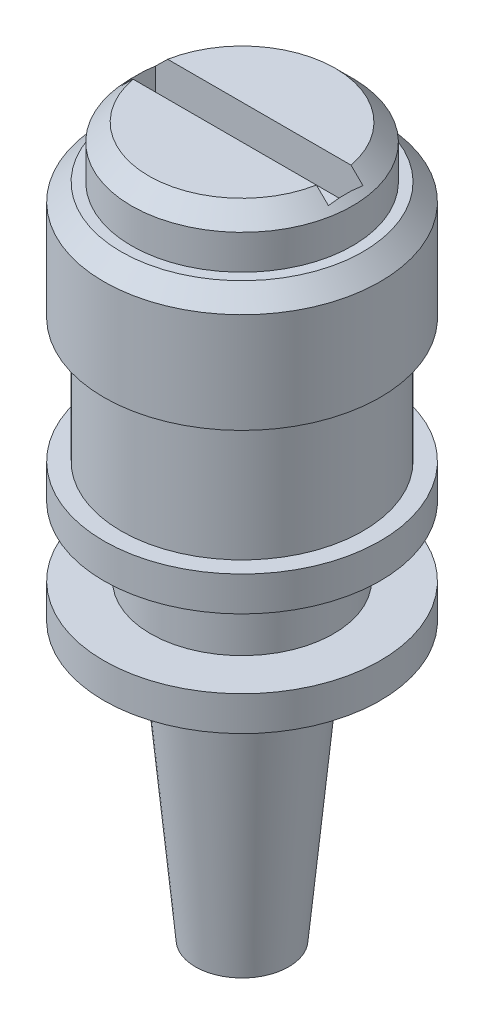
ISO-10303-21;
HEADER;
FILE_DESCRIPTION(('STEP AP214'),'2;1');
FILE_NAME('part.step','',(''),(''),'','','');
FILE_SCHEMA(('AUTOMOTIVE_DESIGN { 1 0 10303 214 1 1 1 1 }'));
ENDSEC;
DATA;
#1=APPLICATION_CONTEXT('core data for automotive mechanical design processes');
#2=APPLICATION_PROTOCOL_DEFINITION('international standard','automotive_design',2000,#1);
#3=PRODUCT_CONTEXT('',#1,'mechanical');
#4=PRODUCT('Part','Part','',(#3));
#5=PRODUCT_RELATED_PRODUCT_CATEGORY('part','',(#4));
#6=PRODUCT_DEFINITION_FORMATION('','',#4);
#7=PRODUCT_DEFINITION_CONTEXT('part definition',#1,'design');
#8=PRODUCT_DEFINITION('design','',#6,#7);
#9=PRODUCT_DEFINITION_SHAPE('','',#8);
#10=(LENGTH_UNIT() NAMED_UNIT(*) SI_UNIT(.MILLI.,.METRE.));
#11=(NAMED_UNIT(*) PLANE_ANGLE_UNIT() SI_UNIT($,.RADIAN.));
#12=(NAMED_UNIT(*) SI_UNIT($,.STERADIAN.) SOLID_ANGLE_UNIT());
#13=UNCERTAINTY_MEASURE_WITH_UNIT(LENGTH_MEASURE(1.E-05),#10,'distance_accuracy_value','');
#14=(GEOMETRIC_REPRESENTATION_CONTEXT(3) GLOBAL_UNCERTAINTY_ASSIGNED_CONTEXT((#13)) GLOBAL_UNIT_ASSIGNED_CONTEXT((#10,
#11,#12)) REPRESENTATION_CONTEXT('',''));
#15=CARTESIAN_POINT('',(0.,0.,0.));
#16=DIRECTION('',(0.,0.,1.));
#17=DIRECTION('',(1.,0.,0.));
#18=AXIS2_PLACEMENT_3D('',#15,#16,#17);
#19=CARTESIAN_POINT('',(-3.19999999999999,20.5,0.));
#20=DIRECTION('',(0.,1.,0.));
#21=DIRECTION('',(0.,0.,1.));
#22=AXIS2_PLACEMENT_3D('',#19,#20,#21);
#23=PLANE('',#22);
#24=DIRECTION('',(1.,0.,0.));
#25=VECTOR('',#24,1.);
#26=CARTESIAN_POINT('',(3.,20.5,0.5));
#27=LINE('',#26,#25);
#28=CARTESIAN_POINT('',(-2.65329983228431,20.5,0.5));
#29=VERTEX_POINT('',#28);
#30=CARTESIAN_POINT('',(2.65329983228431,20.5,0.5));
#31=VERTEX_POINT('',#30);
#32=EDGE_CURVE('E106',#29,#31,#27,.T.);
#33=ORIENTED_EDGE('',*,*,#32,.F.);
#34=CARTESIAN_POINT('',(0.,20.5,0.));
#35=DIRECTION('',(0.,1.,0.));
#36=DIRECTION('',(0.,0.,1.));
#37=AXIS2_PLACEMENT_3D('',#34,#35,#36);
#38=CIRCLE('',#37,2.69999999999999);
#39=EDGE_CURVE('E165',#29,#31,#38,.T.);
#40=ORIENTED_EDGE('',*,*,#39,.T.);
#41=EDGE_LOOP('',(#33,#40));
#42=FACE_BOUND('',#41,.T.);
#43=ADVANCED_FACE('F29',(#42),#23,.T.);
#44=CARTESIAN_POINT('',(0.,0.,0.));
#45=DIRECTION('',(0.,-1.,0.));
#46=DIRECTION('',(0.,0.,-1.));
#47=AXIS2_PLACEMENT_3D('',#44,#45,#46);
#48=PLANE('',#47);
#49=CARTESIAN_POINT('',(0.,0.,0.));
#50=DIRECTION('',(0.,1.,0.));
#51=DIRECTION('',(0.,0.,1.));
#52=AXIS2_PLACEMENT_3D('',#49,#50,#51);
#53=CIRCLE('',#52,1.34999999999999);
#54=CARTESIAN_POINT('',(0.,0.,1.34999999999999));
#55=VERTEX_POINT('',#54);
#56=EDGE_CURVE('E156',#55,#55,#53,.T.);
#57=ORIENTED_EDGE('',*,*,#56,.F.);
#58=EDGE_LOOP('',(#57));
#59=FACE_BOUND('',#58,.T.);
#60=ADVANCED_FACE('F31',(#59),#48,.T.);
#61=CARTESIAN_POINT('',(0.,6.99999999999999,0.));
#62=DIRECTION('',(0.,1.,0.));
#63=DIRECTION('',(0.,0.,1.));
#64=AXIS2_PLACEMENT_3D('',#61,#62,#63);
#65=CONICAL_SURFACE('',#64,1.99999999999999,0.0925916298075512);
#66=ORIENTED_EDGE('',*,*,#56,.T.);
#67=EDGE_LOOP('',(#66));
#68=FACE_BOUND('',#67,.T.);
#69=CARTESIAN_POINT('',(0.,6.99999999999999,0.));
#70=DIRECTION('',(0.,1.,0.));
#71=DIRECTION('',(0.,0.,1.));
#72=AXIS2_PLACEMENT_3D('',#69,#70,#71);
#73=CIRCLE('',#72,1.99999999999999);
#74=CARTESIAN_POINT('',(0.,6.99999999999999,1.99999999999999));
#75=VERTEX_POINT('',#74);
#76=EDGE_CURVE('E153',#75,#75,#73,.T.);
#77=ORIENTED_EDGE('',*,*,#76,.F.);
#78=EDGE_LOOP('',(#77));
#79=FACE_BOUND('',#78,.T.);
#80=ADVANCED_FACE('F220',(#68,#79),#65,.T.);
#81=CARTESIAN_POINT('',(0.,80.,0.));
#82=DIRECTION('',(0.,1.,0.));
#83=DIRECTION('',(0.,0.,1.));
#84=AXIS2_PLACEMENT_3D('',#81,#82,#83);
#85=CYLINDRICAL_SURFACE('',#84,1.99999999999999);
#86=ORIENTED_EDGE('',*,*,#76,.T.);
#87=EDGE_LOOP('',(#86));
#88=FACE_BOUND('',#87,.T.);
#89=CARTESIAN_POINT('',(0.,7.99999999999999,0.));
#90=DIRECTION('',(0.,1.,0.));
#91=DIRECTION('',(0.,0.,1.));
#92=AXIS2_PLACEMENT_3D('',#89,#90,#91);
#93=CIRCLE('',#92,1.99999999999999);
#94=CARTESIAN_POINT('',(0.,7.99999999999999,1.99999999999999));
#95=VERTEX_POINT('',#94);
#96=EDGE_CURVE('E150',#95,#95,#93,.T.);
#97=ORIENTED_EDGE('',*,*,#96,.F.);
#98=EDGE_LOOP('',(#97));
#99=FACE_BOUND('',#98,.T.);
#100=ADVANCED_FACE('F283',(#88,#99),#85,.T.);
#101=CARTESIAN_POINT('',(-1.99999999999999,8.,0.));
#102=DIRECTION('',(0.,-1.,0.));
#103=DIRECTION('',(0.,0.,-1.));
#104=AXIS2_PLACEMENT_3D('',#101,#102,#103);
#105=PLANE('',#104);
#106=ORIENTED_EDGE('',*,*,#96,.T.);
#107=EDGE_LOOP('',(#106));
#108=FACE_BOUND('',#107,.T.);
#109=CARTESIAN_POINT('',(0.,7.99999999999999,0.));
#110=DIRECTION('',(0.,1.,0.));
#111=DIRECTION('',(0.,0.,1.));
#112=AXIS2_PLACEMENT_3D('',#109,#110,#111);
#113=CIRCLE('',#112,3.99999999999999);
#114=CARTESIAN_POINT('',(0.,7.99999999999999,3.99999999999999));
#115=VERTEX_POINT('',#114);
#116=EDGE_CURVE('E147',#115,#115,#113,.T.);
#117=ORIENTED_EDGE('',*,*,#116,.F.);
#118=EDGE_LOOP('',(#117));
#119=FACE_BOUND('',#118,.T.);
#120=ADVANCED_FACE('F279',(#108,#119),#105,.T.);
#121=CARTESIAN_POINT('',(0.,80.,0.));
#122=DIRECTION('',(0.,1.,0.));
#123=DIRECTION('',(0.,0.,1.));
#124=AXIS2_PLACEMENT_3D('',#121,#122,#123);
#125=CYLINDRICAL_SURFACE('',#124,3.99999999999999);
#126=ORIENTED_EDGE('',*,*,#116,.T.);
#127=EDGE_LOOP('',(#126));
#128=FACE_BOUND('',#127,.T.);
#129=CARTESIAN_POINT('',(0.,8.99999999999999,0.));
#130=DIRECTION('',(0.,1.,0.));
#131=DIRECTION('',(0.,0.,1.));
#132=AXIS2_PLACEMENT_3D('',#129,#130,#131);
#133=CIRCLE('',#132,3.99999999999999);
#134=CARTESIAN_POINT('',(0.,8.99999999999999,3.99999999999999));
#135=VERTEX_POINT('',#134);
#136=EDGE_CURVE('E144',#135,#135,#133,.T.);
#137=ORIENTED_EDGE('',*,*,#136,.F.);
#138=EDGE_LOOP('',(#137));
#139=FACE_BOUND('',#138,.T.);
#140=ADVANCED_FACE('F275',(#128,#139),#125,.T.);
#141=CARTESIAN_POINT('',(-3.99999999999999,9.,0.));
#142=DIRECTION('',(0.,1.,0.));
#143=DIRECTION('',(0.,0.,1.));
#144=AXIS2_PLACEMENT_3D('',#141,#142,#143);
#145=PLANE('',#144);
#146=ORIENTED_EDGE('',*,*,#136,.T.);
#147=EDGE_LOOP('',(#146));
#148=FACE_BOUND('',#147,.T.);
#149=CARTESIAN_POINT('',(0.,8.99999999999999,0.));
#150=DIRECTION('',(0.,1.,0.));
#151=DIRECTION('',(0.,0.,1.));
#152=AXIS2_PLACEMENT_3D('',#149,#150,#151);
#153=CIRCLE('',#152,2.64999999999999);
#154=CARTESIAN_POINT('',(0.,8.99999999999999,2.64999999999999));
#155=VERTEX_POINT('',#154);
#156=EDGE_CURVE('E141',#155,#155,#153,.T.);
#157=ORIENTED_EDGE('',*,*,#156,.F.);
#158=EDGE_LOOP('',(#157));
#159=FACE_BOUND('',#158,.T.);
#160=ADVANCED_FACE('F271',(#148,#159),#145,.T.);
#161=CARTESIAN_POINT('',(0.,80.,0.));
#162=DIRECTION('',(0.,1.,0.));
#163=DIRECTION('',(0.,0.,1.));
#164=AXIS2_PLACEMENT_3D('',#161,#162,#163);
#165=CYLINDRICAL_SURFACE('',#164,2.64999999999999);
#166=ORIENTED_EDGE('',*,*,#156,.T.);
#167=EDGE_LOOP('',(#166));
#168=FACE_BOUND('',#167,.T.);
#169=CARTESIAN_POINT('',(0.,11.,0.));
#170=DIRECTION('',(0.,1.,0.));
#171=DIRECTION('',(0.,0.,1.));
#172=AXIS2_PLACEMENT_3D('',#169,#170,#171);
#173=CIRCLE('',#172,2.64999999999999);
#174=CARTESIAN_POINT('',(0.,11.,2.64999999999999));
#175=VERTEX_POINT('',#174);
#176=EDGE_CURVE('E138',#175,#175,#173,.T.);
#177=ORIENTED_EDGE('',*,*,#176,.F.);
#178=EDGE_LOOP('',(#177));
#179=FACE_BOUND('',#178,.T.);
#180=ADVANCED_FACE('F267',(#168,#179),#165,.T.);
#181=CARTESIAN_POINT('',(-2.64999999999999,11.,0.));
#182=DIRECTION('',(0.,-1.,0.));
#183=DIRECTION('',(0.,0.,-1.));
#184=AXIS2_PLACEMENT_3D('',#181,#182,#183);
#185=PLANE('',#184);
#186=ORIENTED_EDGE('',*,*,#176,.T.);
#187=EDGE_LOOP('',(#186));
#188=FACE_BOUND('',#187,.T.);
#189=CARTESIAN_POINT('',(0.,11.,0.));
#190=DIRECTION('',(0.,1.,0.));
#191=DIRECTION('',(0.,0.,1.));
#192=AXIS2_PLACEMENT_3D('',#189,#190,#191);
#193=CIRCLE('',#192,3.99999999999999);
#194=CARTESIAN_POINT('',(0.,11.,3.99999999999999));
#195=VERTEX_POINT('',#194);
#196=EDGE_CURVE('E135',#195,#195,#193,.T.);
#197=ORIENTED_EDGE('',*,*,#196,.F.);
#198=EDGE_LOOP('',(#197));
#199=FACE_BOUND('',#198,.T.);
#200=ADVANCED_FACE('F263',(#188,#199),#185,.T.);
#201=CARTESIAN_POINT('',(0.,80.,0.));
#202=DIRECTION('',(0.,1.,0.));
#203=DIRECTION('',(0.,0.,1.));
#204=AXIS2_PLACEMENT_3D('',#201,#202,#203);
#205=CYLINDRICAL_SURFACE('',#204,3.99999999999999);
#206=ORIENTED_EDGE('',*,*,#196,.T.);
#207=EDGE_LOOP('',(#206));
#208=FACE_BOUND('',#207,.T.);
#209=CARTESIAN_POINT('',(0.,12.,0.));
#210=DIRECTION('',(0.,1.,0.));
#211=DIRECTION('',(0.,0.,1.));
#212=AXIS2_PLACEMENT_3D('',#209,#210,#211);
#213=CIRCLE('',#212,3.99999999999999);
#214=CARTESIAN_POINT('',(0.,12.,3.99999999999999));
#215=VERTEX_POINT('',#214);
#216=EDGE_CURVE('E132',#215,#215,#213,.T.);
#217=ORIENTED_EDGE('',*,*,#216,.F.);
#218=EDGE_LOOP('',(#217));
#219=FACE_BOUND('',#218,.T.);
#220=ADVANCED_FACE('F259',(#208,#219),#205,.T.);
#221=CARTESIAN_POINT('',(-3.99999999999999,12.,0.));
#222=DIRECTION('',(0.,1.,0.));
#223=DIRECTION('',(0.,0.,1.));
#224=AXIS2_PLACEMENT_3D('',#221,#222,#223);
#225=PLANE('',#224);
#226=ORIENTED_EDGE('',*,*,#216,.T.);
#227=EDGE_LOOP('',(#226));
#228=FACE_BOUND('',#227,.T.);
#229=CARTESIAN_POINT('',(0.,12.,0.));
#230=DIRECTION('',(0.,1.,0.));
#231=DIRECTION('',(0.,0.,1.));
#232=AXIS2_PLACEMENT_3D('',#229,#230,#231);
#233=CIRCLE('',#232,3.5);
#234=CARTESIAN_POINT('',(0.,12.,3.5));
#235=VERTEX_POINT('',#234);
#236=EDGE_CURVE('E129',#235,#235,#233,.T.);
#237=ORIENTED_EDGE('',*,*,#236,.F.);
#238=EDGE_LOOP('',(#237));
#239=FACE_BOUND('',#238,.T.);
#240=ADVANCED_FACE('F255',(#228,#239),#225,.T.);
#241=CARTESIAN_POINT('',(0.,80.,0.));
#242=DIRECTION('',(0.,1.,0.));
#243=DIRECTION('',(0.,0.,1.));
#244=AXIS2_PLACEMENT_3D('',#241,#242,#243);
#245=CYLINDRICAL_SURFACE('',#244,3.49999999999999);
#246=ORIENTED_EDGE('',*,*,#236,.T.);
#247=EDGE_LOOP('',(#246));
#248=FACE_BOUND('',#247,.T.);
#249=CARTESIAN_POINT('',(0.,15.6,0.));
#250=DIRECTION('',(0.,1.,0.));
#251=DIRECTION('',(0.,0.,1.));
#252=AXIS2_PLACEMENT_3D('',#249,#250,#251);
#253=CIRCLE('',#252,3.49999999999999);
#254=CARTESIAN_POINT('',(0.,15.6,3.49999999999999));
#255=VERTEX_POINT('',#254);
#256=EDGE_CURVE('E126',#255,#255,#253,.T.);
#257=ORIENTED_EDGE('',*,*,#256,.F.);
#258=EDGE_LOOP('',(#257));
#259=FACE_BOUND('',#258,.T.);
#260=ADVANCED_FACE('F251',(#248,#259),#245,.T.);
#261=CARTESIAN_POINT('',(-3.49999999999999,15.6,0.));
#262=DIRECTION('',(0.,-1.,0.));
#263=DIRECTION('',(0.,0.,-1.));
#264=AXIS2_PLACEMENT_3D('',#261,#262,#263);
#265=PLANE('',#264);
#266=ORIENTED_EDGE('',*,*,#256,.T.);
#267=EDGE_LOOP('',(#266));
#268=FACE_BOUND('',#267,.T.);
#269=CARTESIAN_POINT('',(0.,15.6,0.));
#270=DIRECTION('',(0.,1.,0.));
#271=DIRECTION('',(0.,0.,1.));
#272=AXIS2_PLACEMENT_3D('',#269,#270,#271);
#273=CIRCLE('',#272,4.);
#274=CARTESIAN_POINT('',(0.,15.6,4.));
#275=VERTEX_POINT('',#274);
#276=EDGE_CURVE('E123',#275,#275,#273,.T.);
#277=ORIENTED_EDGE('',*,*,#276,.F.);
#278=EDGE_LOOP('',(#277));
#279=FACE_BOUND('',#278,.T.);
#280=ADVANCED_FACE('F247',(#268,#279),#265,.T.);
#281=CARTESIAN_POINT('',(0.,80.,0.));
#282=DIRECTION('',(0.,1.,0.));
#283=DIRECTION('',(0.,0.,1.));
#284=AXIS2_PLACEMENT_3D('',#281,#282,#283);
#285=CYLINDRICAL_SURFACE('',#284,4.);
#286=CARTESIAN_POINT('',(0.,18.5,0.));
#287=DIRECTION('',(0.,1.,0.));
#288=DIRECTION('',(0.,0.,1.));
#289=AXIS2_PLACEMENT_3D('',#286,#287,#288);
#290=CIRCLE('',#289,4.);
#291=CARTESIAN_POINT('',(0.,18.5,4.));
#292=VERTEX_POINT('',#291);
#293=EDGE_CURVE('E162',#292,#292,#290,.F.);
#294=ORIENTED_EDGE('',*,*,#293,.T.);
#295=EDGE_LOOP('',(#294));
#296=FACE_BOUND('',#295,.T.);
#297=ORIENTED_EDGE('',*,*,#276,.T.);
#298=EDGE_LOOP('',(#297));
#299=FACE_BOUND('',#298,.T.);
#300=ADVANCED_FACE('F240',(#296,#299),#285,.T.);
#301=CARTESIAN_POINT('',(-3.99999999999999,19.,0.));
#302=DIRECTION('',(0.,1.,0.));
#303=DIRECTION('',(0.,0.,1.));
#304=AXIS2_PLACEMENT_3D('',#301,#302,#303);
#305=PLANE('',#304);
#306=CARTESIAN_POINT('',(0.,19.,0.));
#307=DIRECTION('',(0.,1.,0.));
#308=DIRECTION('',(0.,0.,1.));
#309=AXIS2_PLACEMENT_3D('',#306,#307,#308);
#310=CIRCLE('',#309,3.49999999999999);
#311=CARTESIAN_POINT('',(0.,19.,3.49999999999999));
#312=VERTEX_POINT('',#311);
#313=EDGE_CURVE('E159',#312,#312,#310,.T.);
#314=ORIENTED_EDGE('',*,*,#313,.T.);
#315=EDGE_LOOP('',(#314));
#316=FACE_BOUND('',#315,.T.);
#317=CARTESIAN_POINT('',(0.,19.,0.));
#318=DIRECTION('',(0.,1.,0.));
#319=DIRECTION('',(0.,0.,1.));
#320=AXIS2_PLACEMENT_3D('',#317,#318,#319);
#321=CIRCLE('',#320,3.2);
#322=CARTESIAN_POINT('',(0.,19.,3.2));
#323=VERTEX_POINT('',#322);
#324=EDGE_CURVE('E116',#323,#323,#321,.T.);
#325=ORIENTED_EDGE('',*,*,#324,.F.);
#326=EDGE_LOOP('',(#325));
#327=FACE_BOUND('',#326,.T.);
#328=ADVANCED_FACE('F232',(#316,#327),#305,.T.);
#329=CARTESIAN_POINT('',(0.,80.,0.));
#330=DIRECTION('',(0.,1.,0.));
#331=DIRECTION('',(0.,0.,1.));
#332=AXIS2_PLACEMENT_3D('',#329,#330,#331);
#333=CYLINDRICAL_SURFACE('',#332,3.2);
#334=CARTESIAN_POINT('',(0.,20.,0.));
#335=DIRECTION('',(0.,1.,0.));
#336=DIRECTION('',(0.,0.,1.));
#337=AXIS2_PLACEMENT_3D('',#334,#335,#336);
#338=CIRCLE('',#337,3.2);
#339=CARTESIAN_POINT('',(0.,20.,3.2));
#340=VERTEX_POINT('',#339);
#341=EDGE_CURVE('E169',#340,#340,#338,.F.);
#342=ORIENTED_EDGE('',*,*,#341,.T.);
#343=EDGE_LOOP('',(#342));
#344=FACE_BOUND('',#343,.T.);
#345=ORIENTED_EDGE('',*,*,#324,.T.);
#346=EDGE_LOOP('',(#345));
#347=FACE_BOUND('',#346,.T.);
#348=ADVANCED_FACE('F225',(#344,#347),#333,.T.);
#349=DIRECTION('',(-1.,0.,0.));
#350=VECTOR('',#349,1.);
#351=CARTESIAN_POINT('',(3.,20.5,-0.5));
#352=LINE('',#351,#350);
#353=CARTESIAN_POINT('',(2.65329983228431,20.5,-0.5));
#354=VERTEX_POINT('',#353);
#355=CARTESIAN_POINT('',(-2.65329983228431,20.5,-0.5));
#356=VERTEX_POINT('',#355);
#357=EDGE_CURVE('E108',#354,#356,#352,.T.);
#358=ORIENTED_EDGE('',*,*,#357,.F.);
#359=EDGE_CURVE('E168',#354,#356,#38,.T.);
#360=ORIENTED_EDGE('',*,*,#359,.T.);
#361=EDGE_LOOP('',(#358,#360));
#362=FACE_BOUND('',#361,.T.);
#363=ADVANCED_FACE('F216',(#362),#23,.T.);
#364=CARTESIAN_POINT('',(0.,19.,0.));
#365=DIRECTION('',(0.,-1.,0.));
#366=DIRECTION('',(0.,0.,-1.));
#367=AXIS2_PLACEMENT_3D('',#364,#365,#366);
#368=CONICAL_SURFACE('',#367,3.49999999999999,0.785398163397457);
#369=ORIENTED_EDGE('',*,*,#293,.F.);
#370=EDGE_LOOP('',(#369));
#371=FACE_BOUND('',#370,.T.);
#372=ORIENTED_EDGE('',*,*,#313,.F.);
#373=EDGE_LOOP('',(#372));
#374=FACE_BOUND('',#373,.T.);
#375=ADVANCED_FACE('F224',(#371,#374),#368,.T.);
#376=CARTESIAN_POINT('',(0.,20.5,0.));
#377=DIRECTION('',(0.,-1.,0.));
#378=DIRECTION('',(0.,0.,-1.));
#379=AXIS2_PLACEMENT_3D('',#376,#377,#378);
#380=CONICAL_SURFACE('',#379,2.69999999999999,0.785398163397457);
#381=CARTESIAN_POINT('',(-5.10081304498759,18.0747396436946,0.5));
#382=CARTESIAN_POINT('',(-4.90637839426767,18.2682368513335,0.5));
#383=CARTESIAN_POINT('',(-4.71190054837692,18.4616907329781,0.5));
#384=CARTESIAN_POINT('',(-4.32282626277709,18.8484089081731,0.5));
#385=CARTESIAN_POINT('',(-4.12822985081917,19.0416732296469,0.5));
#386=CARTESIAN_POINT('',(-3.73891250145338,19.4278836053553,0.5));
#387=CARTESIAN_POINT('',(-3.544191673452,19.6208297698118,0.5));
#388=CARTESIAN_POINT('',(-3.25182389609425,19.9099916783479,0.5));
#389=CARTESIAN_POINT('',(-3.15431211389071,20.0063440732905,0.5));
#390=CARTESIAN_POINT('',(-2.9591673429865,20.1989298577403,0.5));
#391=CARTESIAN_POINT('',(-2.86153435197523,20.2951632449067,0.5));
#392=CARTESIAN_POINT('',(-2.66600826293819,20.4875663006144,0.5));
#393=CARTESIAN_POINT('',(-2.56811500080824,20.5837358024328,0.5));
#394=CARTESIAN_POINT('',(-2.37211344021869,20.775841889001,0.5));
#395=CARTESIAN_POINT('',(-2.27400515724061,20.8717784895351,0.5));
#396=CARTESIAN_POINT('',(-2.07752102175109,21.0632713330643,0.5));
#397=CARTESIAN_POINT('',(-1.97914534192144,21.1588277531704,0.5));
#398=CARTESIAN_POINT('',(-1.7818875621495,21.349467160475,0.5));
#399=CARTESIAN_POINT('',(-1.68300534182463,21.4445500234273,0.5));
#400=CARTESIAN_POINT('',(-1.53399555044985,21.5866425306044,0.5));
#401=CARTESIAN_POINT('',(-1.48416395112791,21.6339623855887,0.5));
#402=CARTESIAN_POINT('',(-1.38423934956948,21.7283184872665,0.5));
#403=CARTESIAN_POINT('',(-1.33414636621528,21.7753547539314,0.5));
#404=CARTESIAN_POINT('',(-1.23364431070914,21.8690057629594,0.5));
#405=CARTESIAN_POINT('',(-1.18323553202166,21.9156208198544,0.5));
#406=CARTESIAN_POINT('',(-1.0819064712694,22.0083201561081,0.5));
#407=CARTESIAN_POINT('',(-1.03098605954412,22.0544042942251,0.5));
#408=CARTESIAN_POINT('',(-0.928270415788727,22.1458943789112,0.5));
#409=CARTESIAN_POINT('',(-0.876473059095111,22.1912979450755,0.5));
#410=CARTESIAN_POINT('',(-0.77180836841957,22.280793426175,0.5));
#411=CARTESIAN_POINT('',(-0.718941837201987,22.3248862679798,0.5));
#412=CARTESIAN_POINT('',(-0.638201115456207,22.389418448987,0.5));
#413=CARTESIAN_POINT('',(-0.610999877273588,22.4106961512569,0.5));
#414=CARTESIAN_POINT('',(-0.556007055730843,22.4524547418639,0.5));
#415=CARTESIAN_POINT('',(-0.528215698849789,22.4729359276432,0.5));
#416=CARTESIAN_POINT('',(-0.471773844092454,22.5128579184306,0.5));
#417=CARTESIAN_POINT('',(-0.443121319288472,22.5322959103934,0.5));
#418=CARTESIAN_POINT('',(-0.384710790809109,22.5695107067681,0.5));
#419=CARTESIAN_POINT('',(-0.354951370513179,22.5872852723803,0.5));
#420=CARTESIAN_POINT('',(-0.324518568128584,22.6039192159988,0.5));
#421=B_SPLINE_CURVE_WITH_KNOTS('',3,(#381,#382,#383,#384,#385,#386,#387,#388,#389,#390,#391,
#392,#393,#394,#395,#396,#397,#398,#399,#400,#401,#402,#403,#404,#405,#406,#407,#408,#409,#410,
#411,#412,#413,#414,#415,#416,#417,#418,#419,#420),.UNSPECIFIED.,.F.,.F.,(4,2,2,2,2,2,2,2,2,2,2,
2,2,2,2,2,2,2,2,4),(0.,0.822930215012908,1.64571185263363,2.46808599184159,2.87934129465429,
3.29060456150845,3.70228985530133,4.1139464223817,4.52538115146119,4.9369186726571,
5.14307614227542,5.34921891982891,5.55519235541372,5.76121937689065,5.96784955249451,
6.17432995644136,6.27792323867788,6.38147745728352,6.485298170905,6.58925666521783),.UNSPECIFIED.);
#422=CARTESIAN_POINT('',(-3.,20.1586187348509,0.5));
#423=VERTEX_POINT('',#422);
#424=EDGE_CURVE('E11',#423,#29,#421,.T.);
#425=ORIENTED_EDGE('',*,*,#424,.F.);
#426=CARTESIAN_POINT('',(-3.,19.8118682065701,-1.57462282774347));
#427=CARTESIAN_POINT('',(-3.,19.855909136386,-1.47982365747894));
#428=CARTESIAN_POINT('',(-3.,19.8974507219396,-1.38376366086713));
#429=CARTESIAN_POINT('',(-3.,19.9742747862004,-1.18885525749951));
#430=CARTESIAN_POINT('',(-3.,20.0095381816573,-1.08999937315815));
#431=CARTESIAN_POINT('',(-3.,20.0720231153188,-0.890573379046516));
#432=CARTESIAN_POINT('',(-3.,20.0993047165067,-0.790022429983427));
#433=CARTESIAN_POINT('',(-3.,20.1447156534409,-0.586961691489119));
#434=CARTESIAN_POINT('',(-3.,20.1628564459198,-0.484454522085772));
#435=CARTESIAN_POINT('',(-3.,20.1852292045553,-0.307050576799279));
#436=CARTESIAN_POINT('',(-3.,20.1919336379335,-0.232461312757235));
#437=CARTESIAN_POINT('',(-3.,20.1997804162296,-0.0829749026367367));
#438=CARTESIAN_POINT('',(-3.,20.2009221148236,-0.00807772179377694));
#439=CARTESIAN_POINT('',(-3.,20.1975906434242,0.141678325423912));
#440=CARTESIAN_POINT('',(-3.,20.1931108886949,0.216537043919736));
#441=CARTESIAN_POINT('',(-3.,20.1787041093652,0.365712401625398));
#442=CARTESIAN_POINT('',(-3.,20.1687774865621,0.44002908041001));
#443=CARTESIAN_POINT('',(-3.,20.1372399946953,0.626782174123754));
#444=CARTESIAN_POINT('',(-3.,20.1122279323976,0.738651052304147));
#445=CARTESIAN_POINT('',(-3.,20.0520274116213,0.959733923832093));
#446=CARTESIAN_POINT('',(-3.,20.0168229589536,1.06894344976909));
#447=CARTESIAN_POINT('',(-3.,19.9380682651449,1.28465537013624));
#448=CARTESIAN_POINT('',(-3.,19.8944914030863,1.39114786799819));
#449=CARTESIAN_POINT('',(-3.,19.800899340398,1.60080566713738));
#450=CARTESIAN_POINT('',(-3.,19.7509088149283,1.70398191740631));
#451=CARTESIAN_POINT('',(-3.,19.6984560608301,1.80577129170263));
#452=B_SPLINE_CURVE_WITH_KNOTS('',3,(#426,#427,#428,#429,#430,#431,#432,#433,#434,#435,#436,
#437,#438,#439,#440,#441,#442,#443,#444,#445,#446,#447,#448,#449,#450,#451),.UNSPECIFIED.,.F.,
.F.,(4,2,2,2,2,2,2,2,2,2,2,2,4),(0.,0.313689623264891,0.628317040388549,0.940512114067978,
1.25231491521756,1.47679347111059,1.70129810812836,1.92606596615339,2.15081724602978,
2.49410595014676,2.83793629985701,3.18287854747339,3.52653141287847),.UNSPECIFIED.);
#453=CARTESIAN_POINT('',(-3.,20.1586187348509,-0.5));
#454=VERTEX_POINT('',#453);
#455=EDGE_CURVE('E42',#454,#423,#452,.T.);
#456=ORIENTED_EDGE('',*,*,#455,.F.);
#457=CARTESIAN_POINT('',(-0.324518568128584,22.6039192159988,-0.5));
#458=CARTESIAN_POINT('',(-0.35049293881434,22.589741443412,-0.5));
#459=CARTESIAN_POINT('',(-0.375972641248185,22.5747123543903,-0.5));
#460=CARTESIAN_POINT('',(-0.426096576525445,22.5433691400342,-0.5));
#461=CARTESIAN_POINT('',(-0.450741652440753,22.5270563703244,-0.5));
#462=CARTESIAN_POINT('',(-0.499342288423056,22.4935743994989,-0.5));
#463=CARTESIAN_POINT('',(-0.523299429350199,22.4764074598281,-0.5));
#464=CARTESIAN_POINT('',(-0.5707264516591,22.441400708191,-0.5));
#465=CARTESIAN_POINT('',(-0.594196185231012,22.4235606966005,-0.5));
#466=CARTESIAN_POINT('',(-0.663891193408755,22.3694033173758,-0.5));
#467=CARTESIAN_POINT('',(-0.709542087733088,22.3323491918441,-0.5));
#468=CARTESIAN_POINT('',(-0.799881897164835,22.2570263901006,-0.5));
#469=CARTESIAN_POINT('',(-0.844569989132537,22.218756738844,-0.5));
#470=CARTESIAN_POINT('',(-0.970174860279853,22.1092998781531,-0.5));
#471=CARTESIAN_POINT('',(-1.05030477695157,22.0372123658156,-0.5));
#472=CARTESIAN_POINT('',(-1.20936926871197,21.8917298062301,-0.5));
#473=CARTESIAN_POINT('',(-1.28830372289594,21.8183346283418,-0.5));
#474=CARTESIAN_POINT('',(-1.44542777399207,21.6707741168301,-0.5));
#475=CARTESIAN_POINT('',(-1.52361747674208,21.5966088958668,-0.5));
#476=CARTESIAN_POINT('',(-1.6795188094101,21.4477865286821,-0.5));
#477=CARTESIAN_POINT('',(-1.75723046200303,21.373129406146,-0.5));
#478=CARTESIAN_POINT('',(-1.9905190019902,21.1480594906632,-0.5));
#479=CARTESIAN_POINT('',(-2.14561568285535,20.9971493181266,-0.5));
#480=CARTESIAN_POINT('',(-2.45514729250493,20.694664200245,-0.5));
#481=CARTESIAN_POINT('',(-2.60958224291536,20.5430892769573,-0.5));
#482=CARTESIAN_POINT('',(-2.95983785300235,20.1984321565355,-0.5));
#483=CARTESIAN_POINT('',(-3.15553810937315,20.0052276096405,-0.5));
#484=CARTESIAN_POINT('',(-3.54658523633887,19.6184564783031,-0.5));
#485=CARTESIAN_POINT('',(-3.74193210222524,19.4248898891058,-0.5));
#486=CARTESIAN_POINT('',(-4.13128511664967,19.0386405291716,-0.5));
#487=CARTESIAN_POINT('',(-4.32529253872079,18.8459590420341,-0.5));
#488=CARTESIAN_POINT('',(-4.71315173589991,18.460445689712,-0.5));
#489=CARTESIAN_POINT('',(-4.90700351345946,18.2676138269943,-0.5));
#490=CARTESIAN_POINT('',(-5.10081304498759,18.0747396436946,-0.5));
#491=B_SPLINE_CURVE_WITH_KNOTS('',3,(#457,#458,#459,#460,#461,#462,#463,#464,#465,#466,#467,
#468,#469,#470,#471,#472,#473,#474,#475,#476,#477,#478,#479,#480,#481,#482,#483,#484,#485,#486,
#487,#488,#489,#490),.UNSPECIFIED.,.F.,.F.,(4,2,2,2,2,2,2,2,2,2,2,2,2,2,2,2,4),(0.,
0.0887215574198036,0.177350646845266,0.265756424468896,0.354188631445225,0.530538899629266,
0.707034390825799,1.03035080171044,1.3536996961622,1.67700193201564,2.0002887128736,
2.64948282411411,3.29865555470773,4.12366313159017,4.9486816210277,5.76897737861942,
6.58925995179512),.UNSPECIFIED.);
#492=EDGE_CURVE('E194',#356,#454,#491,.T.);
#493=ORIENTED_EDGE('',*,*,#492,.F.);
#494=ORIENTED_EDGE('',*,*,#359,.F.);
#495=CARTESIAN_POINT('',(5.10081304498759,18.0747396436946,-0.5));
#496=CARTESIAN_POINT('',(4.90637839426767,18.2682368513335,-0.5));
#497=CARTESIAN_POINT('',(4.71190054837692,18.4616907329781,-0.5));
#498=CARTESIAN_POINT('',(4.32282626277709,18.8484089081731,-0.5));
#499=CARTESIAN_POINT('',(4.12822985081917,19.0416732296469,-0.5));
#500=CARTESIAN_POINT('',(3.73891250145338,19.4278836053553,-0.5));
#501=CARTESIAN_POINT('',(3.544191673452,19.6208297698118,-0.5));
#502=CARTESIAN_POINT('',(3.25182389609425,19.9099916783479,-0.5));
#503=CARTESIAN_POINT('',(3.15431211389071,20.0063440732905,-0.5));
#504=CARTESIAN_POINT('',(2.9591673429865,20.1989298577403,-0.5));
#505=CARTESIAN_POINT('',(2.86153435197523,20.2951632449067,-0.5));
#506=CARTESIAN_POINT('',(2.66600826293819,20.4875663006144,-0.5));
#507=CARTESIAN_POINT('',(2.56811500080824,20.5837358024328,-0.5));
#508=CARTESIAN_POINT('',(2.37211344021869,20.775841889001,-0.5));
#509=CARTESIAN_POINT('',(2.27400515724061,20.8717784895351,-0.5));
#510=CARTESIAN_POINT('',(2.07752102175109,21.0632713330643,-0.5));
#511=CARTESIAN_POINT('',(1.97914534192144,21.1588277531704,-0.5));
#512=CARTESIAN_POINT('',(1.7818875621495,21.349467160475,-0.5));
#513=CARTESIAN_POINT('',(1.68300534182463,21.4445500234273,-0.5));
#514=CARTESIAN_POINT('',(1.53399555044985,21.5866425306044,-0.5));
#515=CARTESIAN_POINT('',(1.48416395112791,21.6339623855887,-0.5));
#516=CARTESIAN_POINT('',(1.38423934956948,21.7283184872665,-0.5));
#517=CARTESIAN_POINT('',(1.33414636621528,21.7753547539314,-0.5));
#518=CARTESIAN_POINT('',(1.23364431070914,21.8690057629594,-0.5));
#519=CARTESIAN_POINT('',(1.18323553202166,21.9156208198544,-0.5));
#520=CARTESIAN_POINT('',(1.0819064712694,22.0083201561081,-0.5));
#521=CARTESIAN_POINT('',(1.03098605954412,22.0544042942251,-0.5));
#522=CARTESIAN_POINT('',(0.928270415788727,22.1458943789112,-0.5));
#523=CARTESIAN_POINT('',(0.876473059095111,22.1912979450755,-0.5));
#524=CARTESIAN_POINT('',(0.77180836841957,22.280793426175,-0.5));
#525=CARTESIAN_POINT('',(0.718941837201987,22.3248862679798,-0.5));
#526=CARTESIAN_POINT('',(0.638201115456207,22.389418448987,-0.5));
#527=CARTESIAN_POINT('',(0.610999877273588,22.4106961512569,-0.5));
#528=CARTESIAN_POINT('',(0.556007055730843,22.4524547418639,-0.5));
#529=CARTESIAN_POINT('',(0.528215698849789,22.4729359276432,-0.5));
#530=CARTESIAN_POINT('',(0.471773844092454,22.5128579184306,-0.5));
#531=CARTESIAN_POINT('',(0.443121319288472,22.5322959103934,-0.5));
#532=CARTESIAN_POINT('',(0.384710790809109,22.5695107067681,-0.5));
#533=CARTESIAN_POINT('',(0.354951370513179,22.5872852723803,-0.5));
#534=CARTESIAN_POINT('',(0.324518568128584,22.6039192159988,-0.5));
#535=B_SPLINE_CURVE_WITH_KNOTS('',3,(#495,#496,#497,#498,#499,#500,#501,#502,#503,#504,#505,
#506,#507,#508,#509,#510,#511,#512,#513,#514,#515,#516,#517,#518,#519,#520,#521,#522,#523,#524,
#525,#526,#527,#528,#529,#530,#531,#532,#533,#534),.UNSPECIFIED.,.F.,.F.,(4,2,2,2,2,2,2,2,2,2,2,
2,2,2,2,2,2,2,2,4),(0.,0.822930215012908,1.64571185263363,2.46808599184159,2.87934129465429,
3.29060456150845,3.70228985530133,4.1139464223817,4.52538115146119,4.9369186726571,
5.14307614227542,5.34921891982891,5.55519235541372,5.76121937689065,5.96784955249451,
6.17432995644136,6.27792323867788,6.38147745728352,6.485298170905,6.58925666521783),.UNSPECIFIED.);
#536=CARTESIAN_POINT('',(3.,20.1586187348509,-0.5));
#537=VERTEX_POINT('',#536);
#538=EDGE_CURVE('E172',#537,#354,#535,.T.);
#539=ORIENTED_EDGE('',*,*,#538,.F.);
#540=CARTESIAN_POINT('',(3.,19.8118682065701,-1.57462282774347));
#541=CARTESIAN_POINT('',(3.,19.855909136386,-1.47982365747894));
#542=CARTESIAN_POINT('',(3.,19.8974507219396,-1.38376366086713));
#543=CARTESIAN_POINT('',(3.,19.9742747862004,-1.18885525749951));
#544=CARTESIAN_POINT('',(3.,20.0095381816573,-1.08999937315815));
#545=CARTESIAN_POINT('',(3.,20.0720231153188,-0.890573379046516));
#546=CARTESIAN_POINT('',(3.,20.0993047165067,-0.790022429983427));
#547=CARTESIAN_POINT('',(3.,20.1447156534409,-0.586961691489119));
#548=CARTESIAN_POINT('',(3.,20.1628564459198,-0.484454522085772));
#549=CARTESIAN_POINT('',(3.,20.1852292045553,-0.307050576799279));
#550=CARTESIAN_POINT('',(3.,20.1919336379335,-0.232461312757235));
#551=CARTESIAN_POINT('',(3.,20.1997804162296,-0.0829749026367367));
#552=CARTESIAN_POINT('',(3.,20.2009221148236,-0.00807772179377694));
#553=CARTESIAN_POINT('',(3.,20.1975906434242,0.141678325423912));
#554=CARTESIAN_POINT('',(3.,20.1931108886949,0.216537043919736));
#555=CARTESIAN_POINT('',(3.,20.1787041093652,0.365712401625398));
#556=CARTESIAN_POINT('',(3.,20.1687774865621,0.44002908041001));
#557=CARTESIAN_POINT('',(3.,20.1372399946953,0.626782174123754));
#558=CARTESIAN_POINT('',(3.,20.1122279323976,0.738651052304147));
#559=CARTESIAN_POINT('',(3.,20.0520274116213,0.959733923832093));
#560=CARTESIAN_POINT('',(3.,20.0168229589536,1.06894344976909));
#561=CARTESIAN_POINT('',(3.,19.9380682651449,1.28465537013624));
#562=CARTESIAN_POINT('',(3.,19.8944914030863,1.39114786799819));
#563=CARTESIAN_POINT('',(3.,19.800899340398,1.60080566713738));
#564=CARTESIAN_POINT('',(3.,19.7509088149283,1.70398191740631));
#565=CARTESIAN_POINT('',(3.,19.6984560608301,1.80577129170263));
#566=B_SPLINE_CURVE_WITH_KNOTS('',3,(#540,#541,#542,#543,#544,#545,#546,#547,#548,#549,#550,
#551,#552,#553,#554,#555,#556,#557,#558,#559,#560,#561,#562,#563,#564,#565),.UNSPECIFIED.,.F.,
.F.,(4,2,2,2,2,2,2,2,2,2,2,2,4),(0.,0.313689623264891,0.628317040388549,0.940512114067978,
1.25231491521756,1.47679347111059,1.70129810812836,1.92606596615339,2.15081724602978,
2.49410595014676,2.83793629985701,3.18287854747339,3.52653141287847),.UNSPECIFIED.);
#567=CARTESIAN_POINT('',(3.,20.1586187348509,0.5));
#568=VERTEX_POINT('',#567);
#569=EDGE_CURVE('E90',#568,#537,#566,.F.);
#570=ORIENTED_EDGE('',*,*,#569,.F.);
#571=CARTESIAN_POINT('',(0.324518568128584,22.6039192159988,0.5));
#572=CARTESIAN_POINT('',(0.35049293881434,22.589741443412,0.5));
#573=CARTESIAN_POINT('',(0.375972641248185,22.5747123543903,0.5));
#574=CARTESIAN_POINT('',(0.426096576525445,22.5433691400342,0.5));
#575=CARTESIAN_POINT('',(0.450741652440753,22.5270563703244,0.5));
#576=CARTESIAN_POINT('',(0.499342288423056,22.4935743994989,0.5));
#577=CARTESIAN_POINT('',(0.523299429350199,22.4764074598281,0.5));
#578=CARTESIAN_POINT('',(0.5707264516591,22.441400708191,0.5));
#579=CARTESIAN_POINT('',(0.594196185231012,22.4235606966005,0.5));
#580=CARTESIAN_POINT('',(0.663891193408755,22.3694033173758,0.5));
#581=CARTESIAN_POINT('',(0.709542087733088,22.3323491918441,0.5));
#582=CARTESIAN_POINT('',(0.799881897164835,22.2570263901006,0.5));
#583=CARTESIAN_POINT('',(0.844569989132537,22.218756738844,0.5));
#584=CARTESIAN_POINT('',(0.970174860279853,22.1092998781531,0.5));
#585=CARTESIAN_POINT('',(1.05030477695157,22.0372123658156,0.5));
#586=CARTESIAN_POINT('',(1.20936926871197,21.8917298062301,0.5));
#587=CARTESIAN_POINT('',(1.28830372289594,21.8183346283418,0.5));
#588=CARTESIAN_POINT('',(1.44542777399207,21.6707741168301,0.5));
#589=CARTESIAN_POINT('',(1.52361747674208,21.5966088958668,0.5));
#590=CARTESIAN_POINT('',(1.6795188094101,21.4477865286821,0.5));
#591=CARTESIAN_POINT('',(1.75723046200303,21.373129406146,0.5));
#592=CARTESIAN_POINT('',(1.9905190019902,21.1480594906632,0.5));
#593=CARTESIAN_POINT('',(2.14561568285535,20.9971493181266,0.5));
#594=CARTESIAN_POINT('',(2.45514729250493,20.694664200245,0.5));
#595=CARTESIAN_POINT('',(2.60958224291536,20.5430892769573,0.5));
#596=CARTESIAN_POINT('',(2.95983785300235,20.1984321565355,0.5));
#597=CARTESIAN_POINT('',(3.15553810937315,20.0052276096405,0.5));
#598=CARTESIAN_POINT('',(3.54658523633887,19.6184564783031,0.5));
#599=CARTESIAN_POINT('',(3.74193210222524,19.4248898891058,0.5));
#600=CARTESIAN_POINT('',(4.13128511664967,19.0386405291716,0.5));
#601=CARTESIAN_POINT('',(4.32529253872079,18.8459590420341,0.5));
#602=CARTESIAN_POINT('',(4.71315173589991,18.460445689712,0.5));
#603=CARTESIAN_POINT('',(4.90700351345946,18.2676138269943,0.5));
#604=CARTESIAN_POINT('',(5.10081304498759,18.0747396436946,0.5));
#605=B_SPLINE_CURVE_WITH_KNOTS('',3,(#571,#572,#573,#574,#575,#576,#577,#578,#579,#580,#581,
#582,#583,#584,#585,#586,#587,#588,#589,#590,#591,#592,#593,#594,#595,#596,#597,#598,#599,#600,
#601,#602,#603,#604),.UNSPECIFIED.,.F.,.F.,(4,2,2,2,2,2,2,2,2,2,2,2,2,2,2,2,4),(0.,
0.0887215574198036,0.177350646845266,0.265756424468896,0.354188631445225,0.530538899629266,
0.707034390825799,1.03035080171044,1.3536996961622,1.67700193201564,2.0002887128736,
2.64948282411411,3.29865555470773,4.12366313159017,4.9486816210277,5.76897737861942,
6.58925995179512),.UNSPECIFIED.);
#606=EDGE_CURVE('E57',#31,#568,#605,.T.);
#607=ORIENTED_EDGE('',*,*,#606,.F.);
#608=ORIENTED_EDGE('',*,*,#39,.F.);
#609=EDGE_LOOP('',(#425,#456,#493,#494,#539,#570,#607,#608));
#610=FACE_BOUND('',#609,.T.);
#611=ORIENTED_EDGE('',*,*,#341,.F.);
#612=EDGE_LOOP('',(#611));
#613=FACE_BOUND('',#612,.T.);
#614=ADVANCED_FACE('F183',(#610,#613),#380,.T.);
#615=CARTESIAN_POINT('',(3.,19.5,-0.5));
#616=DIRECTION('',(1.,0.,0.));
#617=DIRECTION('',(0.,0.,-1.));
#618=AXIS2_PLACEMENT_3D('',#615,#616,#617);
#619=PLANE('',#618);
#620=ORIENTED_EDGE('',*,*,#569,.T.);
#621=DIRECTION('',(0.,1.,0.));
#622=VECTOR('',#621,1.);
#623=CARTESIAN_POINT('',(3.,19.5,-0.5));
#624=LINE('',#623,#622);
#625=CARTESIAN_POINT('',(3.,19.5,-0.5));
#626=VERTEX_POINT('',#625);
#627=EDGE_CURVE('E49',#626,#537,#624,.T.);
#628=ORIENTED_EDGE('',*,*,#627,.F.);
#629=DIRECTION('',(0.,0.,-1.));
#630=VECTOR('',#629,1.);
#631=CARTESIAN_POINT('',(3.,19.5,-0.5));
#632=LINE('',#631,#630);
#633=CARTESIAN_POINT('',(3.,19.5,0.5));
#634=VERTEX_POINT('',#633);
#635=EDGE_CURVE('E87',#634,#626,#632,.T.);
#636=ORIENTED_EDGE('',*,*,#635,.F.);
#637=DIRECTION('',(0.,1.,0.));
#638=VECTOR('',#637,1.);
#639=CARTESIAN_POINT('',(3.,19.5,0.5));
#640=LINE('',#639,#638);
#641=EDGE_CURVE('E114',#634,#568,#640,.T.);
#642=ORIENTED_EDGE('',*,*,#641,.T.);
#643=EDGE_LOOP('',(#620,#628,#636,#642));
#644=FACE_BOUND('',#643,.T.);
#645=ADVANCED_FACE('F85',(#644),#619,.F.);
#646=CARTESIAN_POINT('',(3.,19.5,0.5));
#647=DIRECTION('',(0.,0.,1.));
#648=DIRECTION('',(1.,0.,0.));
#649=AXIS2_PLACEMENT_3D('',#646,#647,#648);
#650=PLANE('',#649);
#651=ORIENTED_EDGE('',*,*,#424,.T.);
#652=ORIENTED_EDGE('',*,*,#32,.T.);
#653=ORIENTED_EDGE('',*,*,#606,.T.);
#654=ORIENTED_EDGE('',*,*,#641,.F.);
#655=DIRECTION('',(1.,0.,0.));
#656=VECTOR('',#655,1.);
#657=CARTESIAN_POINT('',(3.,19.5,0.5));
#658=LINE('',#657,#656);
#659=CARTESIAN_POINT('',(-3.,19.5,0.5));
#660=VERTEX_POINT('',#659);
#661=EDGE_CURVE('E93',#660,#634,#658,.T.);
#662=ORIENTED_EDGE('',*,*,#661,.F.);
#663=DIRECTION('',(0.,1.,0.));
#664=VECTOR('',#663,1.);
#665=CARTESIAN_POINT('',(-3.,19.5,0.5));
#666=LINE('',#665,#664);
#667=EDGE_CURVE('E117',#660,#423,#666,.T.);
#668=ORIENTED_EDGE('',*,*,#667,.T.);
#669=EDGE_LOOP('',(#651,#652,#653,#654,#662,#668));
#670=FACE_BOUND('',#669,.T.);
#671=ADVANCED_FACE('F209',(#670),#650,.F.);
#672=CARTESIAN_POINT('',(-3.,19.5,-0.5));
#673=DIRECTION('',(-1.,0.,0.));
#674=DIRECTION('',(0.,0.,1.));
#675=AXIS2_PLACEMENT_3D('',#672,#673,#674);
#676=PLANE('',#675);
#677=ORIENTED_EDGE('',*,*,#455,.T.);
#678=ORIENTED_EDGE('',*,*,#667,.F.);
#679=DIRECTION('',(0.,0.,1.));
#680=VECTOR('',#679,1.);
#681=CARTESIAN_POINT('',(-3.,19.5,-0.5));
#682=LINE('',#681,#680);
#683=CARTESIAN_POINT('',(-3.,19.5,-0.5));
#684=VERTEX_POINT('',#683);
#685=EDGE_CURVE('E102',#684,#660,#682,.T.);
#686=ORIENTED_EDGE('',*,*,#685,.F.);
#687=DIRECTION('',(0.,1.,0.));
#688=VECTOR('',#687,1.);
#689=CARTESIAN_POINT('',(-3.,19.5,-0.5));
#690=LINE('',#689,#688);
#691=EDGE_CURVE('E92',#684,#454,#690,.T.);
#692=ORIENTED_EDGE('',*,*,#691,.T.);
#693=EDGE_LOOP('',(#677,#678,#686,#692));
#694=FACE_BOUND('',#693,.T.);
#695=ADVANCED_FACE('F189',(#694),#676,.F.);
#696=CARTESIAN_POINT('',(3.,19.5,-0.5));
#697=DIRECTION('',(0.,0.,-1.));
#698=DIRECTION('',(-1.,0.,0.));
#699=AXIS2_PLACEMENT_3D('',#696,#697,#698);
#700=PLANE('',#699);
#701=ORIENTED_EDGE('',*,*,#492,.T.);
#702=ORIENTED_EDGE('',*,*,#691,.F.);
#703=DIRECTION('',(-1.,0.,0.));
#704=VECTOR('',#703,1.);
#705=CARTESIAN_POINT('',(3.,19.5,-0.5));
#706=LINE('',#705,#704);
#707=EDGE_CURVE('E96',#626,#684,#706,.T.);
#708=ORIENTED_EDGE('',*,*,#707,.F.);
#709=ORIENTED_EDGE('',*,*,#627,.T.);
#710=ORIENTED_EDGE('',*,*,#538,.T.);
#711=ORIENTED_EDGE('',*,*,#357,.T.);
#712=EDGE_LOOP('',(#701,#702,#708,#709,#710,#711));
#713=FACE_BOUND('',#712,.T.);
#714=ADVANCED_FACE('F97',(#713),#700,.F.);
#715=CARTESIAN_POINT('',(3.,19.5,0.5));
#716=DIRECTION('',(0.,-1.,0.));
#717=DIRECTION('',(0.,0.,-1.));
#718=AXIS2_PLACEMENT_3D('',#715,#716,#717);
#719=PLANE('',#718);
#720=ORIENTED_EDGE('',*,*,#635,.T.);
#721=ORIENTED_EDGE('',*,*,#707,.T.);
#722=ORIENTED_EDGE('',*,*,#685,.T.);
#723=ORIENTED_EDGE('',*,*,#661,.T.);
#724=EDGE_LOOP('',(#720,#721,#722,#723));
#725=FACE_BOUND('',#724,.T.);
#726=ADVANCED_FACE('F104',(#725),#719,.F.);
#727=CLOSED_SHELL('',(#43,#60,#80,#100,#120,#140,#160,#180,#200,#220,#240,#260,#280,#300,#328,
#348,#363,#375,#614,#645,#671,#695,#714,#726));
#728=MANIFOLD_SOLID_BREP('B2',#727);
#729=ADVANCED_BREP_SHAPE_REPRESENTATION('',(#18,#728),#14);
#730=SHAPE_DEFINITION_REPRESENTATION(#9,#729);
ENDSEC;
END-ISO-10303-21;
